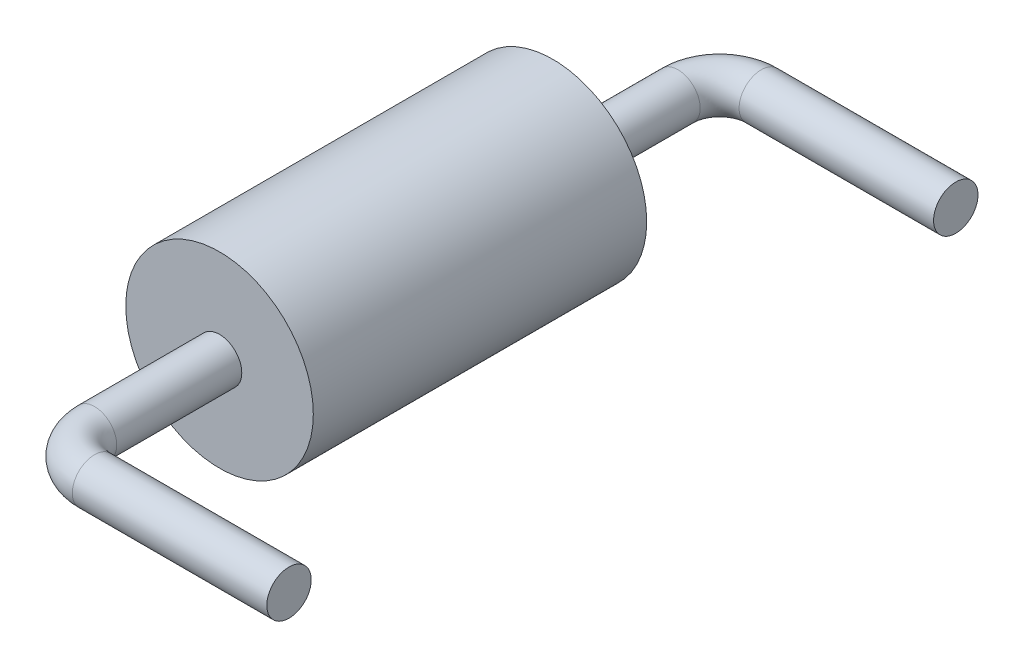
from build123d import *

# Parameters (mm, degrees)
SKETCH2_R           = 1.35
BOSS_EXTRUDE2_DEPTH = 4.8
SKETCH4_R           = 0.32


with BuildPart() as part:
    # Sketch2 → Boss-Extrude2 (new body)
    with BuildSketch(Plane.XY):
        Circle(SKETCH2_R)
    extrude(amount=BOSS_EXTRUDE2_DEPTH)

    # Sweep1: sweep along a path in Sketch3
    with BuildLine(Plane(origin=(0, 0, 0), x_dir=(1, 0, 0), z_dir=(0, 1, 0))) as sweep1_path:
        Line((0, 0), (0, 1.8))
        ThreePointArc((0, 1.8), (0.175735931, 2.224264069), (0.6, 2.4))
        Line((0.6, 2.4), (3.4, 2.4))
    # Sketch4 → Sweep1 (sweep)
    with BuildSketch(Plane(origin=(0, 0, 0), x_dir=(-1, 0, 0), z_dir=(0, 0, -1))):
        Circle(SKETCH4_R)
    sweep1 = sweep(path=sweep1_path.line)

    # Mirror1: Sweep1 across plane
    add(sweep1.mirror(Plane.XY.offset(2.4)))


solid = part.part
